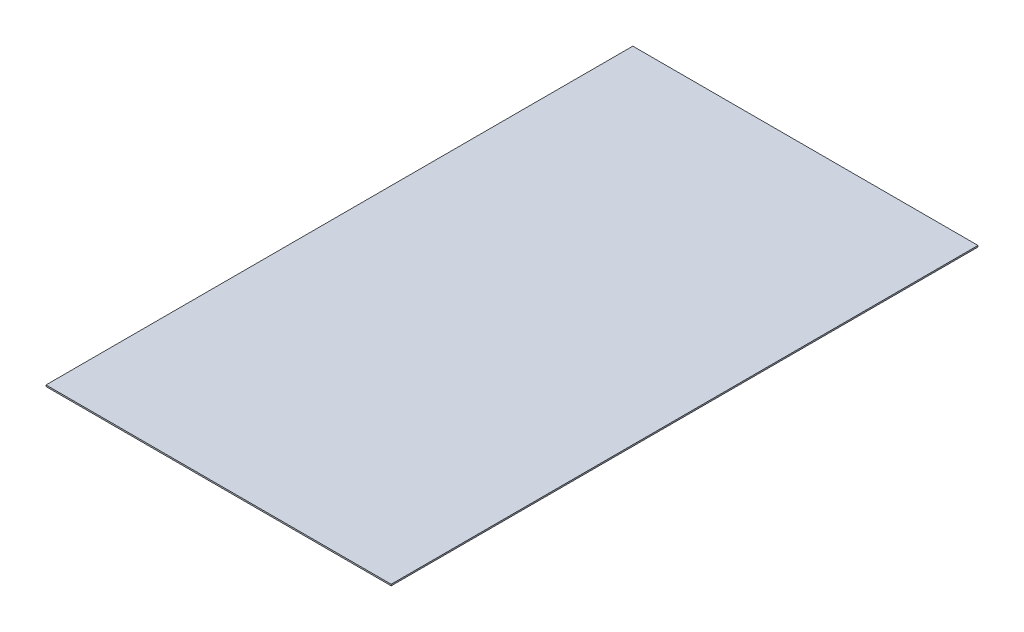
ISO-10303-21;
HEADER;
FILE_DESCRIPTION(('STEP AP214'),'2;1');
FILE_NAME('part.step','',(''),(''),'','','');
FILE_SCHEMA(('AUTOMOTIVE_DESIGN { 1 0 10303 214 1 1 1 1 }'));
ENDSEC;
DATA;
#1=APPLICATION_CONTEXT('core data for automotive mechanical design processes');
#2=APPLICATION_PROTOCOL_DEFINITION('international standard','automotive_design',2000,#1);
#3=PRODUCT_CONTEXT('',#1,'mechanical');
#4=PRODUCT('Part','Part','',(#3));
#5=PRODUCT_RELATED_PRODUCT_CATEGORY('part','',(#4));
#6=PRODUCT_DEFINITION_FORMATION('','',#4);
#7=PRODUCT_DEFINITION_CONTEXT('part definition',#1,'design');
#8=PRODUCT_DEFINITION('design','',#6,#7);
#9=PRODUCT_DEFINITION_SHAPE('','',#8);
#10=(LENGTH_UNIT() NAMED_UNIT(*) SI_UNIT(.MILLI.,.METRE.));
#11=(NAMED_UNIT(*) PLANE_ANGLE_UNIT() SI_UNIT($,.RADIAN.));
#12=(NAMED_UNIT(*) SI_UNIT($,.STERADIAN.) SOLID_ANGLE_UNIT());
#13=UNCERTAINTY_MEASURE_WITH_UNIT(LENGTH_MEASURE(1.E-05),#10,'distance_accuracy_value','');
#14=(GEOMETRIC_REPRESENTATION_CONTEXT(3) GLOBAL_UNCERTAINTY_ASSIGNED_CONTEXT((#13)) GLOBAL_UNIT_ASSIGNED_CONTEXT((#10,
#11,#12)) REPRESENTATION_CONTEXT('',''));
#15=CARTESIAN_POINT('',(0.,0.,0.));
#16=DIRECTION('',(0.,0.,1.));
#17=DIRECTION('',(1.,0.,0.));
#18=AXIS2_PLACEMENT_3D('',#15,#16,#17);
#19=CARTESIAN_POINT('',(1524.,6.35,0.));
#20=DIRECTION('',(-1.,0.,0.));
#21=DIRECTION('',(0.,0.,1.));
#22=AXIS2_PLACEMENT_3D('',#19,#20,#21);
#23=PLANE('',#22);
#24=DIRECTION('',(0.,0.,-1.));
#25=VECTOR('',#24,1.);
#26=CARTESIAN_POINT('',(1524.,0.,0.));
#27=LINE('',#26,#25);
#28=CARTESIAN_POINT('',(1524.,0.,2590.8));
#29=VERTEX_POINT('',#28);
#30=CARTESIAN_POINT('',(1524.,0.,0.));
#31=VERTEX_POINT('',#30);
#32=EDGE_CURVE('E97',#29,#31,#27,.T.);
#33=ORIENTED_EDGE('',*,*,#32,.T.);
#34=DIRECTION('',(0.,-1.,0.));
#35=VECTOR('',#34,1.);
#36=CARTESIAN_POINT('',(1524.,6.35,0.));
#37=LINE('',#36,#35);
#38=CARTESIAN_POINT('',(1524.,6.35,0.));
#39=VERTEX_POINT('',#38);
#40=EDGE_CURVE('E11',#39,#31,#37,.T.);
#41=ORIENTED_EDGE('',*,*,#40,.F.);
#42=DIRECTION('',(0.,0.,-1.));
#43=VECTOR('',#42,1.);
#44=CARTESIAN_POINT('',(1524.,6.35,0.));
#45=LINE('',#44,#43);
#46=CARTESIAN_POINT('',(1524.,6.35,2590.8));
#47=VERTEX_POINT('',#46);
#48=EDGE_CURVE('E85',#47,#39,#45,.T.);
#49=ORIENTED_EDGE('',*,*,#48,.F.);
#50=DIRECTION('',(0.,-1.,0.));
#51=VECTOR('',#50,1.);
#52=CARTESIAN_POINT('',(1524.,6.35,2590.8));
#53=LINE('',#52,#51);
#54=EDGE_CURVE('E93',#47,#29,#53,.T.);
#55=ORIENTED_EDGE('',*,*,#54,.T.);
#56=EDGE_LOOP('',(#33,#41,#49,#55));
#57=FACE_BOUND('',#56,.T.);
#58=ADVANCED_FACE('F34',(#57),#23,.F.);
#59=CARTESIAN_POINT('',(0.,6.35,0.));
#60=DIRECTION('',(0.,0.,1.));
#61=DIRECTION('',(1.,0.,0.));
#62=AXIS2_PLACEMENT_3D('',#59,#60,#61);
#63=PLANE('',#62);
#64=DIRECTION('',(-1.,0.,0.));
#65=VECTOR('',#64,1.);
#66=CARTESIAN_POINT('',(0.,0.,0.));
#67=LINE('',#66,#65);
#68=CARTESIAN_POINT('',(0.,0.,0.));
#69=VERTEX_POINT('',#68);
#70=EDGE_CURVE('E89',#31,#69,#67,.T.);
#71=ORIENTED_EDGE('',*,*,#70,.T.);
#72=DIRECTION('',(0.,-1.,0.));
#73=VECTOR('',#72,1.);
#74=CARTESIAN_POINT('',(0.,6.35,0.));
#75=LINE('',#74,#73);
#76=CARTESIAN_POINT('',(0.,6.35,0.));
#77=VERTEX_POINT('',#76);
#78=EDGE_CURVE('E42',#77,#69,#75,.T.);
#79=ORIENTED_EDGE('',*,*,#78,.F.);
#80=DIRECTION('',(-1.,0.,0.));
#81=VECTOR('',#80,1.);
#82=CARTESIAN_POINT('',(0.,6.35,0.));
#83=LINE('',#82,#81);
#84=EDGE_CURVE('E80',#39,#77,#83,.T.);
#85=ORIENTED_EDGE('',*,*,#84,.F.);
#86=ORIENTED_EDGE('',*,*,#40,.T.);
#87=EDGE_LOOP('',(#71,#79,#85,#86));
#88=FACE_BOUND('',#87,.T.);
#89=ADVANCED_FACE('F88',(#88),#63,.F.);
#90=CARTESIAN_POINT('',(0.,6.35,0.));
#91=DIRECTION('',(1.,0.,0.));
#92=DIRECTION('',(0.,0.,-1.));
#93=AXIS2_PLACEMENT_3D('',#90,#91,#92);
#94=PLANE('',#93);
#95=DIRECTION('',(0.,0.,1.));
#96=VECTOR('',#95,1.);
#97=CARTESIAN_POINT('',(0.,0.,0.));
#98=LINE('',#97,#96);
#99=CARTESIAN_POINT('',(3.19189119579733E-13,0.,2590.8));
#100=VERTEX_POINT('',#99);
#101=EDGE_CURVE('E67',#69,#100,#98,.T.);
#102=ORIENTED_EDGE('',*,*,#101,.T.);
#103=DIRECTION('',(0.,-1.,0.));
#104=VECTOR('',#103,1.);
#105=CARTESIAN_POINT('',(3.19189119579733E-13,6.35,2590.8));
#106=LINE('',#105,#104);
#107=CARTESIAN_POINT('',(3.19189119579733E-13,6.35,2590.8));
#108=VERTEX_POINT('',#107);
#109=EDGE_CURVE('E90',#108,#100,#106,.T.);
#110=ORIENTED_EDGE('',*,*,#109,.F.);
#111=DIRECTION('',(0.,0.,1.));
#112=VECTOR('',#111,1.);
#113=CARTESIAN_POINT('',(0.,6.35,0.));
#114=LINE('',#113,#112);
#115=EDGE_CURVE('E83',#77,#108,#114,.T.);
#116=ORIENTED_EDGE('',*,*,#115,.F.);
#117=ORIENTED_EDGE('',*,*,#78,.T.);
#118=EDGE_LOOP('',(#102,#110,#116,#117));
#119=FACE_BOUND('',#118,.T.);
#120=ADVANCED_FACE('F91',(#119),#94,.F.);
#121=CARTESIAN_POINT('',(3.19189119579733E-13,6.35,2590.8));
#122=DIRECTION('',(0.,0.,-1.));
#123=DIRECTION('',(-1.,0.,0.));
#124=AXIS2_PLACEMENT_3D('',#121,#122,#123);
#125=PLANE('',#124);
#126=DIRECTION('',(1.,0.,0.));
#127=VECTOR('',#126,1.);
#128=CARTESIAN_POINT('',(3.19189119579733E-13,0.,2590.8));
#129=LINE('',#128,#127);
#130=EDGE_CURVE('E73',#100,#29,#129,.T.);
#131=ORIENTED_EDGE('',*,*,#130,.T.);
#132=ORIENTED_EDGE('',*,*,#54,.F.);
#133=DIRECTION('',(1.,0.,0.));
#134=VECTOR('',#133,1.);
#135=CARTESIAN_POINT('',(3.19189119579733E-13,6.35,2590.8));
#136=LINE('',#135,#134);
#137=EDGE_CURVE('E50',#108,#47,#136,.T.);
#138=ORIENTED_EDGE('',*,*,#137,.F.);
#139=ORIENTED_EDGE('',*,*,#109,.T.);
#140=EDGE_LOOP('',(#131,#132,#138,#139));
#141=FACE_BOUND('',#140,.T.);
#142=ADVANCED_FACE('F104',(#141),#125,.F.);
#143=CARTESIAN_POINT('',(1524.,6.35,2590.8));
#144=DIRECTION('',(0.,1.,0.));
#145=DIRECTION('',(0.,0.,1.));
#146=AXIS2_PLACEMENT_3D('',#143,#144,#145);
#147=PLANE('',#146);
#148=ORIENTED_EDGE('',*,*,#48,.T.);
#149=ORIENTED_EDGE('',*,*,#84,.T.);
#150=ORIENTED_EDGE('',*,*,#115,.T.);
#151=ORIENTED_EDGE('',*,*,#137,.T.);
#152=EDGE_LOOP('',(#148,#149,#150,#151));
#153=FACE_BOUND('',#152,.T.);
#154=ADVANCED_FACE('F81',(#153),#147,.T.);
#155=CARTESIAN_POINT('',(1524.,0.,2590.8));
#156=DIRECTION('',(0.,1.,0.));
#157=DIRECTION('',(0.,0.,1.));
#158=AXIS2_PLACEMENT_3D('',#155,#156,#157);
#159=PLANE('',#158);
#160=ORIENTED_EDGE('',*,*,#32,.F.);
#161=ORIENTED_EDGE('',*,*,#130,.F.);
#162=ORIENTED_EDGE('',*,*,#101,.F.);
#163=ORIENTED_EDGE('',*,*,#70,.F.);
#164=EDGE_LOOP('',(#160,#161,#162,#163));
#165=FACE_BOUND('',#164,.T.);
#166=ADVANCED_FACE('F107',(#165),#159,.F.);
#167=CLOSED_SHELL('',(#58,#89,#120,#142,#154,#166));
#168=MANIFOLD_SOLID_BREP('B2',#167);
#169=ADVANCED_BREP_SHAPE_REPRESENTATION('',(#18,#168),#14);
#170=SHAPE_DEFINITION_REPRESENTATION(#9,#169);
ENDSEC;
END-ISO-10303-21;
